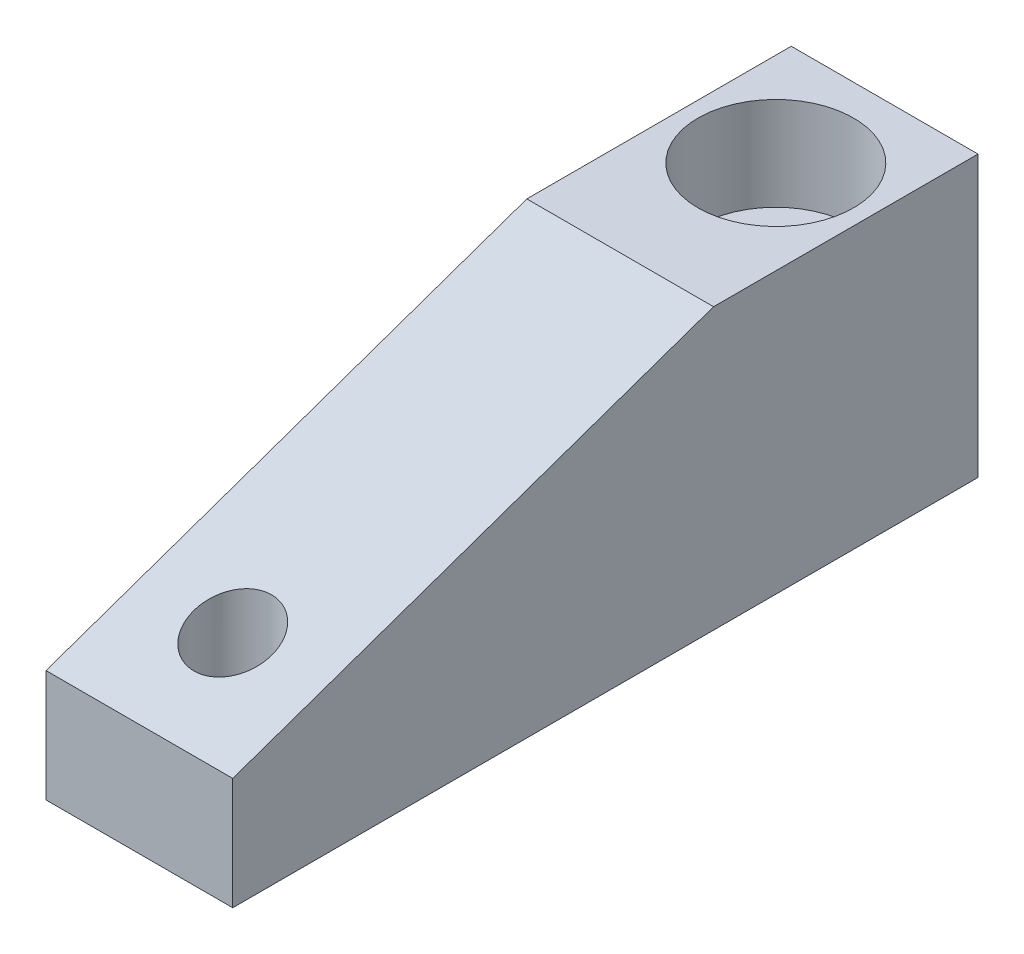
ISO-10303-21;
HEADER;
FILE_DESCRIPTION(('STEP AP214'),'2;1');
FILE_NAME('part.step','',(''),(''),'','','');
FILE_SCHEMA(('AUTOMOTIVE_DESIGN { 1 0 10303 214 1 1 1 1 }'));
ENDSEC;
DATA;
#1=APPLICATION_CONTEXT('core data for automotive mechanical design processes');
#2=APPLICATION_PROTOCOL_DEFINITION('international standard','automotive_design',2000,#1);
#3=PRODUCT_CONTEXT('',#1,'mechanical');
#4=PRODUCT('Part','Part','',(#3));
#5=PRODUCT_RELATED_PRODUCT_CATEGORY('part','',(#4));
#6=PRODUCT_DEFINITION_FORMATION('','',#4);
#7=PRODUCT_DEFINITION_CONTEXT('part definition',#1,'design');
#8=PRODUCT_DEFINITION('design','',#6,#7);
#9=PRODUCT_DEFINITION_SHAPE('','',#8);
#10=(LENGTH_UNIT() NAMED_UNIT(*) SI_UNIT(.MILLI.,.METRE.));
#11=(NAMED_UNIT(*) PLANE_ANGLE_UNIT() SI_UNIT($,.RADIAN.));
#12=(NAMED_UNIT(*) SI_UNIT($,.STERADIAN.) SOLID_ANGLE_UNIT());
#13=UNCERTAINTY_MEASURE_WITH_UNIT(LENGTH_MEASURE(1.E-05),#10,'distance_accuracy_value','');
#14=(GEOMETRIC_REPRESENTATION_CONTEXT(3) GLOBAL_UNCERTAINTY_ASSIGNED_CONTEXT((#13)) GLOBAL_UNIT_ASSIGNED_CONTEXT((#10,
#11,#12)) REPRESENTATION_CONTEXT('',''));
#15=CARTESIAN_POINT('',(0.,0.,0.));
#16=DIRECTION('',(0.,0.,1.));
#17=DIRECTION('',(1.,0.,0.));
#18=AXIS2_PLACEMENT_3D('',#15,#16,#17);
#19=CARTESIAN_POINT('',(0.,28.575,0.));
#20=DIRECTION('',(1.,0.,0.));
#21=DIRECTION('',(0.,0.,-1.));
#22=AXIS2_PLACEMENT_3D('',#19,#20,#21);
#23=PLANE('',#22);
#24=DIRECTION('',(0.,-1.,0.));
#25=VECTOR('',#24,1.);
#26=CARTESIAN_POINT('',(0.,28.575,76.0222));
#27=LINE('',#26,#25);
#28=CARTESIAN_POINT('',(0.,11.43,76.0222));
#29=VERTEX_POINT('',#28);
#30=CARTESIAN_POINT('',(0.,0.,76.0222));
#31=VERTEX_POINT('',#30);
#32=EDGE_CURVE('E112',#29,#31,#27,.T.);
#33=ORIENTED_EDGE('',*,*,#32,.F.);
#34=DIRECTION('',(0.,0.329980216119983,-0.943987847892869));
#35=VECTOR('',#34,1.);
#36=CARTESIAN_POINT('',(0.,11.43,76.0222));
#37=LINE('',#36,#35);
#38=CARTESIAN_POINT('',(0.,28.575,26.9748));
#39=VERTEX_POINT('',#38);
#40=EDGE_CURVE('E178',#29,#39,#37,.T.);
#41=ORIENTED_EDGE('',*,*,#40,.T.);
#42=DIRECTION('',(0.,0.,1.));
#43=VECTOR('',#42,1.);
#44=CARTESIAN_POINT('',(0.,28.575,0.));
#45=LINE('',#44,#43);
#46=CARTESIAN_POINT('',(0.,28.575,0.));
#47=VERTEX_POINT('',#46);
#48=EDGE_CURVE('E86',#47,#39,#45,.T.);
#49=ORIENTED_EDGE('',*,*,#48,.F.);
#50=DIRECTION('',(0.,-1.,0.));
#51=VECTOR('',#50,1.);
#52=CARTESIAN_POINT('',(0.,28.575,0.));
#53=LINE('',#52,#51);
#54=CARTESIAN_POINT('',(0.,0.,0.));
#55=VERTEX_POINT('',#54);
#56=EDGE_CURVE('E79',#47,#55,#53,.T.);
#57=ORIENTED_EDGE('',*,*,#56,.T.);
#58=DIRECTION('',(0.,0.,1.));
#59=VECTOR('',#58,1.);
#60=CARTESIAN_POINT('',(0.,0.,0.));
#61=LINE('',#60,#59);
#62=EDGE_CURVE('E92',#55,#31,#61,.T.);
#63=ORIENTED_EDGE('',*,*,#62,.T.);
#64=EDGE_LOOP('',(#33,#41,#49,#57,#63));
#65=FACE_BOUND('',#64,.T.);
#66=ADVANCED_FACE('F32',(#65),#23,.F.);
#67=CARTESIAN_POINT('',(0.,28.575,76.0222));
#68=DIRECTION('',(0.,0.,-1.));
#69=DIRECTION('',(-1.,0.,0.));
#70=AXIS2_PLACEMENT_3D('',#67,#68,#69);
#71=PLANE('',#70);
#72=DIRECTION('',(0.,-1.,0.));
#73=VECTOR('',#72,1.);
#74=CARTESIAN_POINT('',(19.05,28.575,76.0222));
#75=LINE('',#74,#73);
#76=CARTESIAN_POINT('',(19.05,11.43,76.0222));
#77=VERTEX_POINT('',#76);
#78=CARTESIAN_POINT('',(19.05,0.,76.0222));
#79=VERTEX_POINT('',#78);
#80=EDGE_CURVE('E110',#77,#79,#75,.T.);
#81=ORIENTED_EDGE('',*,*,#80,.F.);
#82=DIRECTION('',(1.,0.,0.));
#83=VECTOR('',#82,1.);
#84=CARTESIAN_POINT('',(0.,11.43,76.0222));
#85=LINE('',#84,#83);
#86=EDGE_CURVE('E182',#29,#77,#85,.T.);
#87=ORIENTED_EDGE('',*,*,#86,.F.);
#88=ORIENTED_EDGE('',*,*,#32,.T.);
#89=DIRECTION('',(1.,0.,0.));
#90=VECTOR('',#89,1.);
#91=CARTESIAN_POINT('',(0.,0.,76.0222));
#92=LINE('',#91,#90);
#93=EDGE_CURVE('E98',#31,#79,#92,.T.);
#94=ORIENTED_EDGE('',*,*,#93,.T.);
#95=EDGE_LOOP('',(#81,#87,#88,#94));
#96=FACE_BOUND('',#95,.T.);
#97=ADVANCED_FACE('F134',(#96),#71,.F.);
#98=CARTESIAN_POINT('',(19.05,28.575,0.));
#99=DIRECTION('',(-1.,0.,0.));
#100=DIRECTION('',(0.,0.,1.));
#101=AXIS2_PLACEMENT_3D('',#98,#99,#100);
#102=PLANE('',#101);
#103=DIRECTION('',(0.,0.,-1.));
#104=VECTOR('',#103,1.);
#105=CARTESIAN_POINT('',(19.05,28.575,0.));
#106=LINE('',#105,#104);
#107=CARTESIAN_POINT('',(19.05,28.575,26.9748));
#108=VERTEX_POINT('',#107);
#109=CARTESIAN_POINT('',(19.05,28.575,0.));
#110=VERTEX_POINT('',#109);
#111=EDGE_CURVE('E198',#108,#110,#106,.T.);
#112=ORIENTED_EDGE('',*,*,#111,.F.);
#113=DIRECTION('',(0.,0.329980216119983,-0.943987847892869));
#114=VECTOR('',#113,1.);
#115=CARTESIAN_POINT('',(19.05,11.43,76.0222));
#116=LINE('',#115,#114);
#117=EDGE_CURVE('E48',#77,#108,#116,.T.);
#118=ORIENTED_EDGE('',*,*,#117,.F.);
#119=ORIENTED_EDGE('',*,*,#80,.T.);
#120=DIRECTION('',(0.,0.,-1.));
#121=VECTOR('',#120,1.);
#122=CARTESIAN_POINT('',(19.05,0.,0.));
#123=LINE('',#122,#121);
#124=CARTESIAN_POINT('',(19.05,0.,0.));
#125=VERTEX_POINT('',#124);
#126=EDGE_CURVE('E87',#79,#125,#123,.T.);
#127=ORIENTED_EDGE('',*,*,#126,.T.);
#128=DIRECTION('',(0.,-1.,0.));
#129=VECTOR('',#128,1.);
#130=CARTESIAN_POINT('',(19.05,28.575,0.));
#131=LINE('',#130,#129);
#132=EDGE_CURVE('E82',#110,#125,#131,.T.);
#133=ORIENTED_EDGE('',*,*,#132,.F.);
#134=EDGE_LOOP('',(#112,#118,#119,#127,#133));
#135=FACE_BOUND('',#134,.T.);
#136=ADVANCED_FACE('F138',(#135),#102,.F.);
#137=CARTESIAN_POINT('',(0.,28.575,0.));
#138=DIRECTION('',(0.,0.,1.));
#139=DIRECTION('',(1.,0.,0.));
#140=AXIS2_PLACEMENT_3D('',#137,#138,#139);
#141=PLANE('',#140);
#142=DIRECTION('',(-1.,0.,0.));
#143=VECTOR('',#142,1.);
#144=CARTESIAN_POINT('',(0.,0.,0.));
#145=LINE('',#144,#143);
#146=EDGE_CURVE('E76',#125,#55,#145,.T.);
#147=ORIENTED_EDGE('',*,*,#146,.T.);
#148=ORIENTED_EDGE('',*,*,#56,.F.);
#149=DIRECTION('',(-1.,0.,0.));
#150=VECTOR('',#149,1.);
#151=CARTESIAN_POINT('',(0.,28.575,0.));
#152=LINE('',#151,#150);
#153=EDGE_CURVE('E57',#110,#47,#152,.T.);
#154=ORIENTED_EDGE('',*,*,#153,.F.);
#155=ORIENTED_EDGE('',*,*,#132,.T.);
#156=EDGE_LOOP('',(#147,#148,#154,#155));
#157=FACE_BOUND('',#156,.T.);
#158=ADVANCED_FACE('F78',(#157),#141,.F.);
#159=CARTESIAN_POINT('',(0.,28.575,76.0222));
#160=DIRECTION('',(0.,1.,0.));
#161=DIRECTION('',(0.,0.,1.));
#162=AXIS2_PLACEMENT_3D('',#159,#160,#161);
#163=PLANE('',#162);
#164=DIRECTION('',(1.,0.,0.));
#165=VECTOR('',#164,1.);
#166=CARTESIAN_POINT('',(0.,28.575,26.9748));
#167=LINE('',#166,#165);
#168=EDGE_CURVE('E184',#39,#108,#167,.T.);
#169=ORIENTED_EDGE('',*,*,#168,.T.);
#170=ORIENTED_EDGE('',*,*,#111,.T.);
#171=ORIENTED_EDGE('',*,*,#153,.T.);
#172=ORIENTED_EDGE('',*,*,#48,.T.);
#173=EDGE_LOOP('',(#169,#170,#171,#172));
#174=FACE_BOUND('',#173,.T.);
#175=CARTESIAN_POINT('',(9.525,28.575,11.0998));
#176=DIRECTION('',(0.,1.,0.));
#177=DIRECTION('',(0.,0.,1.));
#178=AXIS2_PLACEMENT_3D('',#175,#176,#177);
#179=CIRCLE('',#178,7.9375);
#180=CARTESIAN_POINT('',(9.525,28.575,19.0373));
#181=VERTEX_POINT('',#180);
#182=EDGE_CURVE('E99',#181,#181,#179,.T.);
#183=ORIENTED_EDGE('',*,*,#182,.F.);
#184=EDGE_LOOP('',(#183));
#185=FACE_BOUND('',#184,.T.);
#186=ADVANCED_FACE('F147',(#174,#185),#163,.T.);
#187=CARTESIAN_POINT('',(0.,0.,76.0222));
#188=DIRECTION('',(0.,1.,0.));
#189=DIRECTION('',(0.,0.,1.));
#190=AXIS2_PLACEMENT_3D('',#187,#188,#189);
#191=PLANE('',#190);
#192=CARTESIAN_POINT('',(9.525,0.,66.4972));
#193=DIRECTION('',(0.,-1.,0.));
#194=DIRECTION('',(0.,0.,-1.));
#195=AXIS2_PLACEMENT_3D('',#192,#193,#194);
#196=CIRCLE('',#195,3.96239999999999);
#197=CARTESIAN_POINT('',(9.525,0.,62.5348));
#198=VERTEX_POINT('',#197);
#199=EDGE_CURVE('E175',#198,#198,#196,.T.);
#200=ORIENTED_EDGE('',*,*,#199,.F.);
#201=EDGE_LOOP('',(#200));
#202=FACE_BOUND('',#201,.T.);
#203=CARTESIAN_POINT('',(9.525,0.,11.0998));
#204=DIRECTION('',(0.,1.,0.));
#205=DIRECTION('',(0.,0.,1.));
#206=AXIS2_PLACEMENT_3D('',#203,#204,#205);
#207=CIRCLE('',#206,7.9121);
#208=CARTESIAN_POINT('',(9.525,0.,19.0119));
#209=VERTEX_POINT('',#208);
#210=EDGE_CURVE('E186',#209,#209,#207,.T.);
#211=ORIENTED_EDGE('',*,*,#210,.T.);
#212=EDGE_LOOP('',(#211));
#213=FACE_BOUND('',#212,.T.);
#214=ORIENTED_EDGE('',*,*,#62,.F.);
#215=ORIENTED_EDGE('',*,*,#146,.F.);
#216=ORIENTED_EDGE('',*,*,#126,.F.);
#217=ORIENTED_EDGE('',*,*,#93,.F.);
#218=EDGE_LOOP('',(#214,#215,#216,#217));
#219=FACE_BOUND('',#218,.T.);
#220=ADVANCED_FACE('F96',(#202,#213,#219),#191,.F.);
#221=CARTESIAN_POINT('',(9.525,31.6794444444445,11.0998));
#222=DIRECTION('',(0.,1.,0.));
#223=DIRECTION('',(0.,0.,1.));
#224=AXIS2_PLACEMENT_3D('',#221,#222,#223);
#225=CYLINDRICAL_SURFACE('',#224,7.9375);
#226=CARTESIAN_POINT('',(9.525,19.05,11.0998));
#227=DIRECTION('',(0.,1.,0.));
#228=DIRECTION('',(0.,0.,1.));
#229=AXIS2_PLACEMENT_3D('',#226,#227,#228);
#230=CIRCLE('',#229,7.9375);
#231=CARTESIAN_POINT('',(9.525,19.05,19.0373));
#232=VERTEX_POINT('',#231);
#233=EDGE_CURVE('E103',#232,#232,#230,.T.);
#234=ORIENTED_EDGE('',*,*,#233,.F.);
#235=EDGE_LOOP('',(#234));
#236=FACE_BOUND('',#235,.T.);
#237=ORIENTED_EDGE('',*,*,#182,.T.);
#238=EDGE_LOOP('',(#237));
#239=FACE_BOUND('',#238,.T.);
#240=ADVANCED_FACE('F150',(#236,#239),#225,.F.);
#241=CARTESIAN_POINT('',(9.525,19.05,19.0373));
#242=DIRECTION('',(0.,-1.,0.));
#243=DIRECTION('',(0.,0.,-1.));
#244=AXIS2_PLACEMENT_3D('',#241,#242,#243);
#245=PLANE('',#244);
#246=CARTESIAN_POINT('',(9.525,19.05,11.0998));
#247=DIRECTION('',(0.,1.,0.));
#248=DIRECTION('',(0.,0.,1.));
#249=AXIS2_PLACEMENT_3D('',#246,#247,#248);
#250=CIRCLE('',#249,4.953);
#251=CARTESIAN_POINT('',(9.525,19.05,16.0528));
#252=VERTEX_POINT('',#251);
#253=EDGE_CURVE('E193',#252,#252,#250,.T.);
#254=ORIENTED_EDGE('',*,*,#253,.F.);
#255=EDGE_LOOP('',(#254));
#256=FACE_BOUND('',#255,.T.);
#257=ORIENTED_EDGE('',*,*,#233,.T.);
#258=EDGE_LOOP('',(#257));
#259=FACE_BOUND('',#258,.T.);
#260=ADVANCED_FACE('F156',(#256,#259),#245,.F.);
#261=CARTESIAN_POINT('',(9.525,31.6794444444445,11.0998));
#262=DIRECTION('',(0.,1.,0.));
#263=DIRECTION('',(0.,0.,1.));
#264=AXIS2_PLACEMENT_3D('',#261,#262,#263);
#265=CYLINDRICAL_SURFACE('',#264,4.953);
#266=CARTESIAN_POINT('',(9.525,13.1064,11.0998));
#267=DIRECTION('',(0.,1.,0.));
#268=DIRECTION('',(0.,0.,1.));
#269=AXIS2_PLACEMENT_3D('',#266,#267,#268);
#270=CIRCLE('',#269,4.953);
#271=CARTESIAN_POINT('',(9.525,13.1064,16.0528));
#272=VERTEX_POINT('',#271);
#273=EDGE_CURVE('E190',#272,#272,#270,.T.);
#274=ORIENTED_EDGE('',*,*,#273,.F.);
#275=EDGE_LOOP('',(#274));
#276=FACE_BOUND('',#275,.T.);
#277=ORIENTED_EDGE('',*,*,#253,.T.);
#278=EDGE_LOOP('',(#277));
#279=FACE_BOUND('',#278,.T.);
#280=ADVANCED_FACE('F160',(#276,#279),#265,.F.);
#281=CARTESIAN_POINT('',(9.525,13.1064,16.0528));
#282=DIRECTION('',(0.,1.,0.));
#283=DIRECTION('',(0.,0.,1.));
#284=AXIS2_PLACEMENT_3D('',#281,#282,#283);
#285=PLANE('',#284);
#286=CARTESIAN_POINT('',(9.525,13.1064,11.0998));
#287=DIRECTION('',(0.,1.,0.));
#288=DIRECTION('',(0.,0.,1.));
#289=AXIS2_PLACEMENT_3D('',#286,#287,#288);
#290=CIRCLE('',#289,7.13100010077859);
#291=CARTESIAN_POINT('',(9.525,13.1064,18.2308001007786));
#292=VERTEX_POINT('',#291);
#293=EDGE_CURVE('E11',#292,#292,#290,.F.);
#294=ORIENTED_EDGE('',*,*,#293,.T.);
#295=EDGE_LOOP('',(#294));
#296=FACE_BOUND('',#295,.T.);
#297=ORIENTED_EDGE('',*,*,#273,.T.);
#298=EDGE_LOOP('',(#297));
#299=FACE_BOUND('',#298,.T.);
#300=ADVANCED_FACE('F130',(#296,#299),#285,.F.);
#301=CARTESIAN_POINT('',(9.525,13.1064,11.0998));
#302=DIRECTION('',(0.,-1.,0.));
#303=DIRECTION('',(0.,0.,-1.));
#304=AXIS2_PLACEMENT_3D('',#301,#302,#303);
#305=CONICAL_SURFACE('',#304,7.50021478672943,0.0314159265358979);
#306=CARTESIAN_POINT('',(9.525,12.7373674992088,11.0998));
#307=DIRECTION('',(0.,-1.,0.));
#308=DIRECTION('',(0.,0.,-1.));
#309=AXIS2_PLACEMENT_3D('',#306,#307,#308);
#310=CIRCLE('',#309,7.51181210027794);
#311=CARTESIAN_POINT('',(9.525,12.7373674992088,3.58798789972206));
#312=VERTEX_POINT('',#311);
#313=EDGE_CURVE('E41',#312,#312,#310,.F.);
#314=ORIENTED_EDGE('',*,*,#313,.T.);
#315=EDGE_LOOP('',(#314));
#316=FACE_BOUND('',#315,.T.);
#317=ORIENTED_EDGE('',*,*,#210,.F.);
#318=EDGE_LOOP('',(#317));
#319=FACE_BOUND('',#318,.T.);
#320=ADVANCED_FACE('F117',(#316,#319),#305,.F.);
#321=CARTESIAN_POINT('',(9.525,12.7254,11.0998));
#322=DIRECTION('',(0.,1.,0.));
#323=DIRECTION('',(0.,0.,1.));
#324=AXIS2_PLACEMENT_3D('',#321,#322,#323);
#325=TOROIDAL_SURFACE('',#324,7.13100010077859,0.381);
#326=ORIENTED_EDGE('',*,*,#293,.F.);
#327=EDGE_LOOP('',(#326));
#328=FACE_BOUND('',#327,.T.);
#329=ORIENTED_EDGE('',*,*,#313,.F.);
#330=EDGE_LOOP('',(#329));
#331=FACE_BOUND('',#330,.T.);
#332=ADVANCED_FACE('F34',(#328,#331),#325,.F.);
#333=CARTESIAN_POINT('',(0.,11.43,76.0222));
#334=DIRECTION('',(0.,-0.943987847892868,-0.329980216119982));
#335=DIRECTION('',(0.,0.329980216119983,-0.943987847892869));
#336=AXIS2_PLACEMENT_3D('',#333,#334,#335);
#337=PLANE('',#336);
#338=CARTESIAN_POINT('',(9.525,14.7595572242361,66.4972));
#339=DIRECTION('',(0.,-0.943987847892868,-0.329980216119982));
#340=DIRECTION('',(0.,-0.329980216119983,0.943987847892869));
#341=AXIS2_PLACEMENT_3D('',#338,#339,#340);
#342=ELLIPSE('',#341,4.19751166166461,3.96239999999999);
#343=CARTESIAN_POINT('',(9.525,13.3744614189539,70.4596));
#344=VERTEX_POINT('',#343);
#345=EDGE_CURVE('E36',#344,#344,#342,.T.);
#346=ORIENTED_EDGE('',*,*,#345,.T.);
#347=EDGE_LOOP('',(#346));
#348=FACE_BOUND('',#347,.T.);
#349=ORIENTED_EDGE('',*,*,#117,.T.);
#350=ORIENTED_EDGE('',*,*,#168,.F.);
#351=ORIENTED_EDGE('',*,*,#40,.F.);
#352=ORIENTED_EDGE('',*,*,#86,.T.);
#353=EDGE_LOOP('',(#349,#350,#351,#352));
#354=FACE_BOUND('',#353,.T.);
#355=ADVANCED_FACE('F121',(#348,#354),#337,.F.);
#356=CARTESIAN_POINT('',(9.525,28.575,66.4972));
#357=DIRECTION('',(0.,-1.,0.));
#358=DIRECTION('',(0.,0.,-1.));
#359=AXIS2_PLACEMENT_3D('',#356,#357,#358);
#360=CYLINDRICAL_SURFACE('',#359,3.96239999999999);
#361=ORIENTED_EDGE('',*,*,#199,.T.);
#362=EDGE_LOOP('',(#361));
#363=FACE_BOUND('',#362,.T.);
#364=ORIENTED_EDGE('',*,*,#345,.F.);
#365=EDGE_LOOP('',(#364));
#366=FACE_BOUND('',#365,.T.);
#367=ADVANCED_FACE('F127',(#363,#366),#360,.F.);
#368=CLOSED_SHELL('',(#66,#97,#136,#158,#186,#220,#240,#260,#280,#300,#320,#332,#355,#367));
#369=MANIFOLD_SOLID_BREP('B2',#368);
#370=ADVANCED_BREP_SHAPE_REPRESENTATION('',(#18,#369),#14);
#371=SHAPE_DEFINITION_REPRESENTATION(#9,#370);
ENDSEC;
END-ISO-10303-21;
